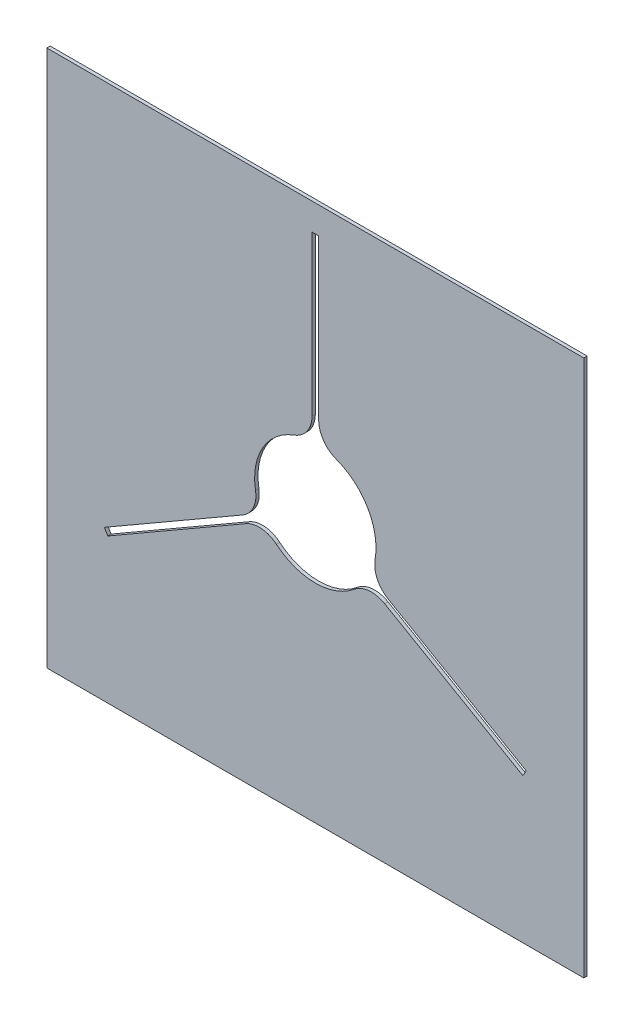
ISO-10303-21;
HEADER;
FILE_DESCRIPTION(('STEP AP214'),'2;1');
FILE_NAME('part.step','',(''),(''),'','','');
FILE_SCHEMA(('AUTOMOTIVE_DESIGN { 1 0 10303 214 1 1 1 1 }'));
ENDSEC;
DATA;
#1=APPLICATION_CONTEXT('core data for automotive mechanical design processes');
#2=APPLICATION_PROTOCOL_DEFINITION('international standard','automotive_design',2000,#1);
#3=PRODUCT_CONTEXT('',#1,'mechanical');
#4=PRODUCT('Part','Part','',(#3));
#5=PRODUCT_RELATED_PRODUCT_CATEGORY('part','',(#4));
#6=PRODUCT_DEFINITION_FORMATION('','',#4);
#7=PRODUCT_DEFINITION_CONTEXT('part definition',#1,'design');
#8=PRODUCT_DEFINITION('design','',#6,#7);
#9=PRODUCT_DEFINITION_SHAPE('','',#8);
#10=(LENGTH_UNIT() NAMED_UNIT(*) SI_UNIT(.MILLI.,.METRE.));
#11=(NAMED_UNIT(*) PLANE_ANGLE_UNIT() SI_UNIT($,.RADIAN.));
#12=(NAMED_UNIT(*) SI_UNIT($,.STERADIAN.) SOLID_ANGLE_UNIT());
#13=UNCERTAINTY_MEASURE_WITH_UNIT(LENGTH_MEASURE(1.E-05),#10,'distance_accuracy_value','');
#14=(GEOMETRIC_REPRESENTATION_CONTEXT(3) GLOBAL_UNCERTAINTY_ASSIGNED_CONTEXT((#13)) GLOBAL_UNIT_ASSIGNED_CONTEXT((#10,
#11,#12)) REPRESENTATION_CONTEXT('',''));
#15=CARTESIAN_POINT('',(0.,0.,0.));
#16=DIRECTION('',(0.,0.,1.));
#17=DIRECTION('',(1.,0.,0.));
#18=AXIS2_PLACEMENT_3D('',#15,#16,#17);
#19=CARTESIAN_POINT('',(0.,0.,0.));
#20=DIRECTION('',(0.,0.,1.));
#21=DIRECTION('',(1.,0.,0.));
#22=AXIS2_PLACEMENT_3D('',#19,#20,#21);
#23=CYLINDRICAL_SURFACE('',#22,28.702);
#24=CARTESIAN_POINT('',(0.,0.,1.5875));
#25=DIRECTION('',(0.,0.,1.));
#26=DIRECTION('',(1.,0.,0.));
#27=AXIS2_PLACEMENT_3D('',#24,#25,#26);
#28=CIRCLE('',#27,28.702);
#29=CARTESIAN_POINT('',(-9.90483128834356,26.9388032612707,1.5875));
#30=VERTEX_POINT('',#29);
#31=CARTESIAN_POINT('',(-28.2821036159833,-4.89156611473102,1.5875));
#32=VERTEX_POINT('',#31);
#33=EDGE_CURVE('E271',#30,#32,#28,.T.);
#34=ORIENTED_EDGE('',*,*,#33,.T.);
#35=DIRECTION('',(0.,0.,1.));
#36=VECTOR('',#35,1.);
#37=CARTESIAN_POINT('',(-28.2821036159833,-4.89156611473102,0.));
#38=LINE('',#37,#36);
#39=CARTESIAN_POINT('',(-28.2821036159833,-4.89156611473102,0.));
#40=VERTEX_POINT('',#39);
#41=EDGE_CURVE('E323',#32,#40,#38,.F.);
#42=ORIENTED_EDGE('',*,*,#41,.T.);
#43=CARTESIAN_POINT('',(0.,0.,0.));
#44=DIRECTION('',(0.,0.,1.));
#45=DIRECTION('',(1.,0.,0.));
#46=AXIS2_PLACEMENT_3D('',#43,#44,#45);
#47=CIRCLE('',#46,28.702);
#48=CARTESIAN_POINT('',(-9.90483128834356,26.9388032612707,0.));
#49=VERTEX_POINT('',#48);
#50=EDGE_CURVE('E265',#49,#40,#47,.T.);
#51=ORIENTED_EDGE('',*,*,#50,.F.);
#52=DIRECTION('',(0.,0.,1.));
#53=VECTOR('',#52,1.);
#54=CARTESIAN_POINT('',(-9.90483128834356,26.9388032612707,0.));
#55=LINE('',#54,#53);
#56=EDGE_CURVE('E304',#49,#30,#55,.T.);
#57=ORIENTED_EDGE('',*,*,#56,.T.);
#58=EDGE_LOOP('',(#34,#42,#51,#57));
#59=FACE_BOUND('',#58,.T.);
#60=ADVANCED_FACE('F39',(#59),#23,.F.);
#61=CARTESIAN_POINT('',(-18.3772723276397,-22.0472371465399,1.5875));
#62=VERTEX_POINT('',#61);
#63=CARTESIAN_POINT('',(18.37727232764,-22.0472371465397,1.5875));
#64=VERTEX_POINT('',#63);
#65=EDGE_CURVE('E274',#62,#64,#28,.T.);
#66=ORIENTED_EDGE('',*,*,#65,.T.);
#67=DIRECTION('',(0.,0.,1.));
#68=VECTOR('',#67,1.);
#69=CARTESIAN_POINT('',(18.37727232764,-22.0472371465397,0.));
#70=LINE('',#69,#68);
#71=CARTESIAN_POINT('',(18.37727232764,-22.0472371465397,0.));
#72=VERTEX_POINT('',#71);
#73=EDGE_CURVE('E341',#64,#72,#70,.F.);
#74=ORIENTED_EDGE('',*,*,#73,.T.);
#75=CARTESIAN_POINT('',(-18.3772723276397,-22.0472371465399,0.));
#76=VERTEX_POINT('',#75);
#77=EDGE_CURVE('E269',#76,#72,#47,.T.);
#78=ORIENTED_EDGE('',*,*,#77,.F.);
#79=DIRECTION('',(0.,0.,1.));
#80=VECTOR('',#79,1.);
#81=CARTESIAN_POINT('',(-18.3772723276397,-22.0472371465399,0.));
#82=LINE('',#81,#80);
#83=EDGE_CURVE('E336',#76,#62,#82,.T.);
#84=ORIENTED_EDGE('',*,*,#83,.T.);
#85=EDGE_LOOP('',(#66,#74,#78,#84));
#86=FACE_BOUND('',#85,.T.);
#87=ADVANCED_FACE('F364',(#86),#23,.F.);
#88=CARTESIAN_POINT('',(127.,127.,1.5875));
#89=DIRECTION('',(-1.,0.,0.));
#90=DIRECTION('',(0.,-1.,0.));
#91=AXIS2_PLACEMENT_3D('',#88,#89,#90);
#92=PLANE('',#91);
#93=DIRECTION('',(0.,1.,0.));
#94=VECTOR('',#93,1.);
#95=CARTESIAN_POINT('',(127.,127.,0.));
#96=LINE('',#95,#94);
#97=CARTESIAN_POINT('',(127.,-127.,0.));
#98=VERTEX_POINT('',#97);
#99=CARTESIAN_POINT('',(127.,127.,0.));
#100=VERTEX_POINT('',#99);
#101=EDGE_CURVE('E268',#98,#100,#96,.T.);
#102=ORIENTED_EDGE('',*,*,#101,.T.);
#103=DIRECTION('',(0.,0.,-1.));
#104=VECTOR('',#103,1.);
#105=CARTESIAN_POINT('',(127.,127.,1.5875));
#106=LINE('',#105,#104);
#107=CARTESIAN_POINT('',(127.,127.,1.5875));
#108=VERTEX_POINT('',#107);
#109=EDGE_CURVE('E301',#108,#100,#106,.T.);
#110=ORIENTED_EDGE('',*,*,#109,.F.);
#111=DIRECTION('',(0.,1.,0.));
#112=VECTOR('',#111,1.);
#113=CARTESIAN_POINT('',(127.,127.,1.5875));
#114=LINE('',#113,#112);
#115=CARTESIAN_POINT('',(127.,-127.,1.5875));
#116=VERTEX_POINT('',#115);
#117=EDGE_CURVE('E275',#116,#108,#114,.T.);
#118=ORIENTED_EDGE('',*,*,#117,.F.);
#119=DIRECTION('',(0.,0.,-1.));
#120=VECTOR('',#119,1.);
#121=CARTESIAN_POINT('',(127.,-127.,1.5875));
#122=LINE('',#121,#120);
#123=EDGE_CURVE('E285',#116,#98,#122,.T.);
#124=ORIENTED_EDGE('',*,*,#123,.T.);
#125=EDGE_LOOP('',(#102,#110,#118,#124));
#126=FACE_BOUND('',#125,.T.);
#127=ADVANCED_FACE('F431',(#126),#92,.F.);
#128=CARTESIAN_POINT('',(-127.,127.,1.5875));
#129=DIRECTION('',(0.,-1.,0.));
#130=DIRECTION('',(0.,0.,-1.));
#131=AXIS2_PLACEMENT_3D('',#128,#129,#130);
#132=PLANE('',#131);
#133=DIRECTION('',(-1.,0.,0.));
#134=VECTOR('',#133,1.);
#135=CARTESIAN_POINT('',(-127.,127.,0.));
#136=LINE('',#135,#134);
#137=CARTESIAN_POINT('',(-127.,127.,0.));
#138=VERTEX_POINT('',#137);
#139=EDGE_CURVE('E288',#100,#138,#136,.T.);
#140=ORIENTED_EDGE('',*,*,#139,.T.);
#141=DIRECTION('',(0.,0.,-1.));
#142=VECTOR('',#141,1.);
#143=CARTESIAN_POINT('',(-127.,127.,1.5875));
#144=LINE('',#143,#142);
#145=CARTESIAN_POINT('',(-127.,127.,1.5875));
#146=VERTEX_POINT('',#145);
#147=EDGE_CURVE('E298',#146,#138,#144,.T.);
#148=ORIENTED_EDGE('',*,*,#147,.F.);
#149=DIRECTION('',(-1.,0.,0.));
#150=VECTOR('',#149,1.);
#151=CARTESIAN_POINT('',(-127.,127.,1.5875));
#152=LINE('',#151,#150);
#153=EDGE_CURVE('E278',#108,#146,#152,.T.);
#154=ORIENTED_EDGE('',*,*,#153,.F.);
#155=ORIENTED_EDGE('',*,*,#109,.T.);
#156=EDGE_LOOP('',(#140,#148,#154,#155));
#157=FACE_BOUND('',#156,.T.);
#158=ADVANCED_FACE('F452',(#157),#132,.F.);
#159=CARTESIAN_POINT('',(-127.,127.,1.5875));
#160=DIRECTION('',(1.,0.,0.));
#161=DIRECTION('',(0.,1.,0.));
#162=AXIS2_PLACEMENT_3D('',#159,#160,#161);
#163=PLANE('',#162);
#164=DIRECTION('',(0.,-1.,0.));
#165=VECTOR('',#164,1.);
#166=CARTESIAN_POINT('',(-127.,127.,0.));
#167=LINE('',#166,#165);
#168=CARTESIAN_POINT('',(-127.,-127.,0.));
#169=VERTEX_POINT('',#168);
#170=EDGE_CURVE('E290',#138,#169,#167,.T.);
#171=ORIENTED_EDGE('',*,*,#170,.T.);
#172=DIRECTION('',(0.,0.,-1.));
#173=VECTOR('',#172,1.);
#174=CARTESIAN_POINT('',(-127.,-127.,1.5875));
#175=LINE('',#174,#173);
#176=CARTESIAN_POINT('',(-127.,-127.,1.5875));
#177=VERTEX_POINT('',#176);
#178=EDGE_CURVE('E295',#177,#169,#175,.T.);
#179=ORIENTED_EDGE('',*,*,#178,.F.);
#180=DIRECTION('',(0.,-1.,0.));
#181=VECTOR('',#180,1.);
#182=CARTESIAN_POINT('',(-127.,127.,1.5875));
#183=LINE('',#182,#181);
#184=EDGE_CURVE('E281',#146,#177,#183,.T.);
#185=ORIENTED_EDGE('',*,*,#184,.F.);
#186=ORIENTED_EDGE('',*,*,#147,.T.);
#187=EDGE_LOOP('',(#171,#179,#185,#186));
#188=FACE_BOUND('',#187,.T.);
#189=ADVANCED_FACE('F448',(#188),#163,.F.);
#190=CARTESIAN_POINT('',(-127.,-127.,1.5875));
#191=DIRECTION('',(0.,1.,0.));
#192=DIRECTION('',(0.,0.,1.));
#193=AXIS2_PLACEMENT_3D('',#190,#191,#192);
#194=PLANE('',#193);
#195=DIRECTION('',(1.,0.,0.));
#196=VECTOR('',#195,1.);
#197=CARTESIAN_POINT('',(-127.,-127.,0.));
#198=LINE('',#197,#196);
#199=EDGE_CURVE('E279',#169,#98,#198,.T.);
#200=ORIENTED_EDGE('',*,*,#199,.T.);
#201=ORIENTED_EDGE('',*,*,#123,.F.);
#202=DIRECTION('',(1.,0.,0.));
#203=VECTOR('',#202,1.);
#204=CARTESIAN_POINT('',(-127.,-127.,1.5875));
#205=LINE('',#204,#203);
#206=EDGE_CURVE('E283',#177,#116,#205,.T.);
#207=ORIENTED_EDGE('',*,*,#206,.F.);
#208=ORIENTED_EDGE('',*,*,#178,.T.);
#209=EDGE_LOOP('',(#200,#201,#207,#208));
#210=FACE_BOUND('',#209,.T.);
#211=ADVANCED_FACE('F444',(#210),#194,.F.);
#212=CARTESIAN_POINT('',(0.,0.,1.5875));
#213=DIRECTION('',(0.,0.,1.));
#214=DIRECTION('',(1.,0.,0.));
#215=AXIS2_PLACEMENT_3D('',#212,#213,#214);
#216=PLANE('',#215);
#217=DIRECTION('',(0.866025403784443,-0.499999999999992,0.));
#218=VECTOR('',#217,1.);
#219=CARTESIAN_POINT('',(98.1929536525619,-58.5248153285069,1.5875));
#220=LINE('',#219,#218);
#221=CARTESIAN_POINT('',(32.8588087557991,-20.8041291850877,1.5875));
#222=VERTEX_POINT('',#221);
#223=CARTESIAN_POINT('',(98.1929536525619,-58.5248153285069,1.5875));
#224=VERTEX_POINT('',#223);
#225=EDGE_CURVE('E205',#222,#224,#220,.T.);
#226=ORIENTED_EDGE('',*,*,#225,.F.);
#227=CARTESIAN_POINT('',(26.5088087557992,-31.8026518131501,1.5875));
#228=DIRECTION('',(0.,0.,1.));
#229=DIRECTION('',(1.,0.,0.));
#230=AXIS2_PLACEMENT_3D('',#227,#228,#229);
#231=CIRCLE('',#230,12.7);
#232=EDGE_CURVE('E350',#222,#64,#231,.T.);
#233=ORIENTED_EDGE('',*,*,#232,.T.);
#234=ORIENTED_EDGE('',*,*,#65,.F.);
#235=CARTESIAN_POINT('',(-26.5088087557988,-31.8026518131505,1.5875));
#236=DIRECTION('',(0.,0.,1.));
#237=DIRECTION('',(1.,0.,0.));
#238=AXIS2_PLACEMENT_3D('',#235,#236,#237);
#239=CIRCLE('',#238,12.7);
#240=CARTESIAN_POINT('',(-32.8588087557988,-20.8041291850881,1.5875));
#241=VERTEX_POINT('',#240);
#242=EDGE_CURVE('E332',#62,#241,#239,.T.);
#243=ORIENTED_EDGE('',*,*,#242,.T.);
#244=DIRECTION('',(0.866025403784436,0.500000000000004,0.));
#245=VECTOR('',#244,1.);
#246=CARTESIAN_POINT('',(-98.1929536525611,-58.5248153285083,1.5875));
#247=LINE('',#246,#245);
#248=CARTESIAN_POINT('',(-98.1929536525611,-58.5248153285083,1.5875));
#249=VERTEX_POINT('',#248);
#250=EDGE_CURVE('E226',#249,#241,#247,.T.);
#251=ORIENTED_EDGE('',*,*,#250,.F.);
#252=DIRECTION('',(0.500000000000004,-0.866025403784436,0.));
#253=VECTOR('',#252,1.);
#254=CARTESIAN_POINT('',(-98.1929536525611,-58.5248153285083,1.5875));
#255=LINE('',#254,#253);
#256=CARTESIAN_POINT('',(-99.7804536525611,-55.7751846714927,1.5875));
#257=VERTEX_POINT('',#256);
#258=EDGE_CURVE('E234',#257,#249,#255,.T.);
#259=ORIENTED_EDGE('',*,*,#258,.F.);
#260=DIRECTION('',(-0.866025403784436,-0.500000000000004,0.));
#261=VECTOR('',#260,1.);
#262=CARTESIAN_POINT('',(-99.7804536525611,-55.7751846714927,1.5875));
#263=LINE('',#262,#261);
#264=CARTESIAN_POINT('',(-34.4463087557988,-18.0544985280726,1.5875));
#265=VERTEX_POINT('',#264);
#266=EDGE_CURVE('E221',#265,#257,#263,.T.);
#267=ORIENTED_EDGE('',*,*,#266,.F.);
#268=CARTESIAN_POINT('',(-40.7963087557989,-7.05597590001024,1.5875));
#269=DIRECTION('',(0.,0.,1.));
#270=DIRECTION('',(1.,0.,0.));
#271=AXIS2_PLACEMENT_3D('',#268,#269,#270);
#272=CIRCLE('',#271,12.7);
#273=EDGE_CURVE('E334',#265,#32,#272,.T.);
#274=ORIENTED_EDGE('',*,*,#273,.T.);
#275=ORIENTED_EDGE('',*,*,#33,.F.);
#276=CARTESIAN_POINT('',(-14.2875,38.8586277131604,1.5875));
#277=DIRECTION('',(0.,0.,1.));
#278=DIRECTION('',(1.,0.,0.));
#279=AXIS2_PLACEMENT_3D('',#276,#277,#278);
#280=CIRCLE('',#279,12.7);
#281=CARTESIAN_POINT('',(-1.5875,38.8586277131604,1.5875));
#282=VERTEX_POINT('',#281);
#283=EDGE_CURVE('E316',#30,#282,#280,.T.);
#284=ORIENTED_EDGE('',*,*,#283,.T.);
#285=DIRECTION('',(0.,-1.,0.));
#286=VECTOR('',#285,1.);
#287=CARTESIAN_POINT('',(-1.58750000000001,114.3,1.5875));
#288=LINE('',#287,#286);
#289=CARTESIAN_POINT('',(-1.58750000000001,114.3,1.5875));
#290=VERTEX_POINT('',#289);
#291=EDGE_CURVE('E247',#290,#282,#288,.T.);
#292=ORIENTED_EDGE('',*,*,#291,.F.);
#293=DIRECTION('',(-1.,0.,0.));
#294=VECTOR('',#293,1.);
#295=CARTESIAN_POINT('',(-1.58750000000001,114.3,1.5875));
#296=LINE('',#295,#294);
#297=CARTESIAN_POINT('',(1.58749999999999,114.3,1.5875));
#298=VERTEX_POINT('',#297);
#299=EDGE_CURVE('E255',#298,#290,#296,.T.);
#300=ORIENTED_EDGE('',*,*,#299,.F.);
#301=DIRECTION('',(0.,1.,0.));
#302=VECTOR('',#301,1.);
#303=CARTESIAN_POINT('',(1.58749999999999,114.3,1.5875));
#304=LINE('',#303,#302);
#305=CARTESIAN_POINT('',(1.5875,38.8586277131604,1.5875));
#306=VERTEX_POINT('',#305);
#307=EDGE_CURVE('E241',#306,#298,#304,.T.);
#308=ORIENTED_EDGE('',*,*,#307,.F.);
#309=CARTESIAN_POINT('',(14.2875,38.8586277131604,1.5875));
#310=DIRECTION('',(0.,0.,1.));
#311=DIRECTION('',(1.,0.,0.));
#312=AXIS2_PLACEMENT_3D('',#309,#310,#311);
#313=CIRCLE('',#312,12.7);
#314=CARTESIAN_POINT('',(9.90483128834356,26.9388032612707,1.5875));
#315=VERTEX_POINT('',#314);
#316=EDGE_CURVE('E318',#306,#315,#313,.T.);
#317=ORIENTED_EDGE('',*,*,#316,.T.);
#318=CARTESIAN_POINT('',(28.2821036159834,-4.89156611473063,1.5875));
#319=VERTEX_POINT('',#318);
#320=EDGE_CURVE('E262',#319,#315,#28,.T.);
#321=ORIENTED_EDGE('',*,*,#320,.F.);
#322=CARTESIAN_POINT('',(40.796308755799,-7.05597590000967,1.5875));
#323=DIRECTION('',(0.,0.,1.));
#324=DIRECTION('',(1.,0.,0.));
#325=AXIS2_PLACEMENT_3D('',#322,#323,#324);
#326=CIRCLE('',#325,12.7);
#327=CARTESIAN_POINT('',(34.4463087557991,-18.0544985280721,1.5875));
#328=VERTEX_POINT('',#327);
#329=EDGE_CURVE('E54',#319,#328,#326,.T.);
#330=ORIENTED_EDGE('',*,*,#329,.T.);
#331=DIRECTION('',(-0.866025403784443,0.499999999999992,0.));
#332=VECTOR('',#331,1.);
#333=CARTESIAN_POINT('',(99.7804536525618,-55.7751846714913,1.5875));
#334=LINE('',#333,#332);
#335=CARTESIAN_POINT('',(99.7804536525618,-55.7751846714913,1.5875));
#336=VERTEX_POINT('',#335);
#337=EDGE_CURVE('E199',#336,#328,#334,.T.);
#338=ORIENTED_EDGE('',*,*,#337,.F.);
#339=DIRECTION('',(0.499999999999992,0.866025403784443,0.));
#340=VECTOR('',#339,1.);
#341=CARTESIAN_POINT('',(99.7804536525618,-55.7751846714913,1.5875));
#342=LINE('',#341,#340);
#343=EDGE_CURVE('E218',#224,#336,#342,.T.);
#344=ORIENTED_EDGE('',*,*,#343,.F.);
#345=EDGE_LOOP('',(#226,#233,#234,#243,#251,#259,#267,#274,#275,#284,#292,#300,#308,#317,#321,
#330,#338,#344));
#346=FACE_BOUND('',#345,.T.);
#347=ORIENTED_EDGE('',*,*,#117,.T.);
#348=ORIENTED_EDGE('',*,*,#153,.T.);
#349=ORIENTED_EDGE('',*,*,#184,.T.);
#350=ORIENTED_EDGE('',*,*,#206,.T.);
#351=EDGE_LOOP('',(#347,#348,#349,#350));
#352=FACE_BOUND('',#351,.T.);
#353=ADVANCED_FACE('F355',(#346,#352),#216,.T.);
#354=CARTESIAN_POINT('',(0.,0.,0.));
#355=DIRECTION('',(0.,0.,1.));
#356=DIRECTION('',(1.,0.,0.));
#357=AXIS2_PLACEMENT_3D('',#354,#355,#356);
#358=PLANE('',#357);
#359=ORIENTED_EDGE('',*,*,#77,.T.);
#360=CARTESIAN_POINT('',(26.5088087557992,-31.8026518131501,0.));
#361=DIRECTION('',(0.,0.,1.));
#362=DIRECTION('',(1.,0.,0.));
#363=AXIS2_PLACEMENT_3D('',#360,#361,#362);
#364=CIRCLE('',#363,12.7);
#365=CARTESIAN_POINT('',(32.8588087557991,-20.8041291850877,0.));
#366=VERTEX_POINT('',#365);
#367=EDGE_CURVE('E196',#72,#366,#364,.F.);
#368=ORIENTED_EDGE('',*,*,#367,.T.);
#369=DIRECTION('',(0.866025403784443,-0.499999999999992,0.));
#370=VECTOR('',#369,1.);
#371=CARTESIAN_POINT('',(98.1929536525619,-58.5248153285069,0.));
#372=LINE('',#371,#370);
#373=CARTESIAN_POINT('',(98.1929536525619,-58.5248153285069,0.));
#374=VERTEX_POINT('',#373);
#375=EDGE_CURVE('E188',#366,#374,#372,.T.);
#376=ORIENTED_EDGE('',*,*,#375,.T.);
#377=DIRECTION('',(0.499999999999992,0.866025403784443,0.));
#378=VECTOR('',#377,1.);
#379=CARTESIAN_POINT('',(99.7804536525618,-55.7751846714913,0.));
#380=LINE('',#379,#378);
#381=CARTESIAN_POINT('',(99.7804536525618,-55.7751846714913,0.));
#382=VERTEX_POINT('',#381);
#383=EDGE_CURVE('E195',#374,#382,#380,.T.);
#384=ORIENTED_EDGE('',*,*,#383,.T.);
#385=DIRECTION('',(-0.866025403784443,0.499999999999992,0.));
#386=VECTOR('',#385,1.);
#387=CARTESIAN_POINT('',(99.7804536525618,-55.7751846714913,0.));
#388=LINE('',#387,#386);
#389=CARTESIAN_POINT('',(34.4463087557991,-18.0544985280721,0.));
#390=VERTEX_POINT('',#389);
#391=EDGE_CURVE('E210',#382,#390,#388,.T.);
#392=ORIENTED_EDGE('',*,*,#391,.T.);
#393=CARTESIAN_POINT('',(40.796308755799,-7.05597590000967,0.));
#394=DIRECTION('',(0.,0.,1.));
#395=DIRECTION('',(1.,0.,0.));
#396=AXIS2_PLACEMENT_3D('',#393,#394,#395);
#397=CIRCLE('',#396,12.7);
#398=CARTESIAN_POINT('',(28.2821036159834,-4.89156611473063,0.));
#399=VERTEX_POINT('',#398);
#400=EDGE_CURVE('E344',#390,#399,#397,.F.);
#401=ORIENTED_EDGE('',*,*,#400,.T.);
#402=CARTESIAN_POINT('',(9.90483128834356,26.9388032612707,0.));
#403=VERTEX_POINT('',#402);
#404=EDGE_CURVE('E270',#399,#403,#47,.T.);
#405=ORIENTED_EDGE('',*,*,#404,.T.);
#406=CARTESIAN_POINT('',(14.2875,38.8586277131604,0.));
#407=DIRECTION('',(0.,0.,1.));
#408=DIRECTION('',(1.,0.,0.));
#409=AXIS2_PLACEMENT_3D('',#406,#407,#408);
#410=CIRCLE('',#409,12.7);
#411=CARTESIAN_POINT('',(1.5875,38.8586277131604,0.));
#412=VERTEX_POINT('',#411);
#413=EDGE_CURVE('E312',#403,#412,#410,.F.);
#414=ORIENTED_EDGE('',*,*,#413,.T.);
#415=DIRECTION('',(0.,1.,0.));
#416=VECTOR('',#415,1.);
#417=CARTESIAN_POINT('',(1.58749999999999,114.3,0.));
#418=LINE('',#417,#416);
#419=CARTESIAN_POINT('',(1.58749999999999,114.3,0.));
#420=VERTEX_POINT('',#419);
#421=EDGE_CURVE('E244',#412,#420,#418,.T.);
#422=ORIENTED_EDGE('',*,*,#421,.T.);
#423=DIRECTION('',(-1.,0.,0.));
#424=VECTOR('',#423,1.);
#425=CARTESIAN_POINT('',(-1.58750000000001,114.3,0.));
#426=LINE('',#425,#424);
#427=CARTESIAN_POINT('',(-1.58750000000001,114.3,0.));
#428=VERTEX_POINT('',#427);
#429=EDGE_CURVE('E246',#420,#428,#426,.T.);
#430=ORIENTED_EDGE('',*,*,#429,.T.);
#431=DIRECTION('',(0.,-1.,0.));
#432=VECTOR('',#431,1.);
#433=CARTESIAN_POINT('',(-1.58750000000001,114.3,0.));
#434=LINE('',#433,#432);
#435=CARTESIAN_POINT('',(-1.5875,38.8586277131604,0.));
#436=VERTEX_POINT('',#435);
#437=EDGE_CURVE('E250',#428,#436,#434,.T.);
#438=ORIENTED_EDGE('',*,*,#437,.T.);
#439=CARTESIAN_POINT('',(-14.2875,38.8586277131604,0.));
#440=DIRECTION('',(0.,0.,1.));
#441=DIRECTION('',(1.,0.,0.));
#442=AXIS2_PLACEMENT_3D('',#439,#440,#441);
#443=CIRCLE('',#442,12.7);
#444=EDGE_CURVE('E310',#436,#49,#443,.F.);
#445=ORIENTED_EDGE('',*,*,#444,.T.);
#446=ORIENTED_EDGE('',*,*,#50,.T.);
#447=CARTESIAN_POINT('',(-40.7963087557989,-7.05597590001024,0.));
#448=DIRECTION('',(0.,0.,1.));
#449=DIRECTION('',(1.,0.,0.));
#450=AXIS2_PLACEMENT_3D('',#447,#448,#449);
#451=CIRCLE('',#450,12.7);
#452=CARTESIAN_POINT('',(-34.4463087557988,-18.0544985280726,0.));
#453=VERTEX_POINT('',#452);
#454=EDGE_CURVE('E328',#40,#453,#451,.F.);
#455=ORIENTED_EDGE('',*,*,#454,.T.);
#456=DIRECTION('',(-0.866025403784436,-0.500000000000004,0.));
#457=VECTOR('',#456,1.);
#458=CARTESIAN_POINT('',(-99.7804536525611,-55.7751846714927,0.));
#459=LINE('',#458,#457);
#460=CARTESIAN_POINT('',(-99.7804536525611,-55.7751846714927,0.));
#461=VERTEX_POINT('',#460);
#462=EDGE_CURVE('E223',#453,#461,#459,.T.);
#463=ORIENTED_EDGE('',*,*,#462,.T.);
#464=DIRECTION('',(0.500000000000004,-0.866025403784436,0.));
#465=VECTOR('',#464,1.);
#466=CARTESIAN_POINT('',(-98.1929536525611,-58.5248153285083,0.));
#467=LINE('',#466,#465);
#468=CARTESIAN_POINT('',(-98.1929536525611,-58.5248153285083,0.));
#469=VERTEX_POINT('',#468);
#470=EDGE_CURVE('E225',#461,#469,#467,.T.);
#471=ORIENTED_EDGE('',*,*,#470,.T.);
#472=DIRECTION('',(0.866025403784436,0.500000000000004,0.));
#473=VECTOR('',#472,1.);
#474=CARTESIAN_POINT('',(-98.1929536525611,-58.5248153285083,0.));
#475=LINE('',#474,#473);
#476=CARTESIAN_POINT('',(-32.8588087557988,-20.8041291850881,0.));
#477=VERTEX_POINT('',#476);
#478=EDGE_CURVE('E229',#469,#477,#475,.T.);
#479=ORIENTED_EDGE('',*,*,#478,.T.);
#480=CARTESIAN_POINT('',(-26.5088087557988,-31.8026518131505,0.));
#481=DIRECTION('',(0.,0.,1.));
#482=DIRECTION('',(1.,0.,0.));
#483=AXIS2_PLACEMENT_3D('',#480,#481,#482);
#484=CIRCLE('',#483,12.7);
#485=EDGE_CURVE('E326',#477,#76,#484,.F.);
#486=ORIENTED_EDGE('',*,*,#485,.T.);
#487=EDGE_LOOP('',(#359,#368,#376,#384,#392,#401,#405,#414,#422,#430,#438,#445,#446,#455,#463,
#471,#479,#486));
#488=FACE_BOUND('',#487,.T.);
#489=ORIENTED_EDGE('',*,*,#101,.F.);
#490=ORIENTED_EDGE('',*,*,#199,.F.);
#491=ORIENTED_EDGE('',*,*,#170,.F.);
#492=ORIENTED_EDGE('',*,*,#139,.F.);
#493=EDGE_LOOP('',(#489,#490,#491,#492));
#494=FACE_BOUND('',#493,.T.);
#495=ADVANCED_FACE('F191',(#488,#494),#358,.F.);
#496=ORIENTED_EDGE('',*,*,#404,.F.);
#497=DIRECTION('',(0.,0.,1.));
#498=VECTOR('',#497,1.);
#499=CARTESIAN_POINT('',(28.2821036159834,-4.89156611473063,0.));
#500=LINE('',#499,#498);
#501=EDGE_CURVE('E47',#399,#319,#500,.T.);
#502=ORIENTED_EDGE('',*,*,#501,.T.);
#503=ORIENTED_EDGE('',*,*,#320,.T.);
#504=DIRECTION('',(0.,0.,1.));
#505=VECTOR('',#504,1.);
#506=CARTESIAN_POINT('',(9.90483128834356,26.9388032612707,0.));
#507=LINE('',#506,#505);
#508=EDGE_CURVE('E307',#315,#403,#507,.F.);
#509=ORIENTED_EDGE('',*,*,#508,.T.);
#510=EDGE_LOOP('',(#496,#502,#503,#509));
#511=FACE_BOUND('',#510,.T.);
#512=ADVANCED_FACE('F353',(#511),#23,.F.);
#513=CARTESIAN_POINT('',(1.58749999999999,114.3,0.));
#514=DIRECTION('',(1.,0.,0.));
#515=DIRECTION('',(0.,1.,0.));
#516=AXIS2_PLACEMENT_3D('',#513,#514,#515);
#517=PLANE('',#516);
#518=ORIENTED_EDGE('',*,*,#421,.F.);
#519=DIRECTION('',(0.,0.,1.));
#520=VECTOR('',#519,1.);
#521=CARTESIAN_POINT('',(1.5875,38.8586277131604,0.));
#522=LINE('',#521,#520);
#523=EDGE_CURVE('E314',#412,#306,#522,.T.);
#524=ORIENTED_EDGE('',*,*,#523,.T.);
#525=ORIENTED_EDGE('',*,*,#307,.T.);
#526=DIRECTION('',(0.,0.,1.));
#527=VECTOR('',#526,1.);
#528=CARTESIAN_POINT('',(1.58749999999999,114.3,0.));
#529=LINE('',#528,#527);
#530=EDGE_CURVE('E253',#420,#298,#529,.T.);
#531=ORIENTED_EDGE('',*,*,#530,.F.);
#532=EDGE_LOOP('',(#518,#524,#525,#531));
#533=FACE_BOUND('',#532,.T.);
#534=ADVANCED_FACE('F378',(#533),#517,.F.);
#535=CARTESIAN_POINT('',(-1.58750000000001,114.3,0.));
#536=DIRECTION('',(-1.,0.,0.));
#537=DIRECTION('',(0.,-1.,0.));
#538=AXIS2_PLACEMENT_3D('',#535,#536,#537);
#539=PLANE('',#538);
#540=ORIENTED_EDGE('',*,*,#291,.T.);
#541=DIRECTION('',(0.,0.,1.));
#542=VECTOR('',#541,1.);
#543=CARTESIAN_POINT('',(-1.5875,38.8586277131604,0.));
#544=LINE('',#543,#542);
#545=EDGE_CURVE('E321',#282,#436,#544,.F.);
#546=ORIENTED_EDGE('',*,*,#545,.T.);
#547=ORIENTED_EDGE('',*,*,#437,.F.);
#548=DIRECTION('',(0.,0.,1.));
#549=VECTOR('',#548,1.);
#550=CARTESIAN_POINT('',(-1.58750000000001,114.3,0.));
#551=LINE('',#550,#549);
#552=EDGE_CURVE('E260',#428,#290,#551,.T.);
#553=ORIENTED_EDGE('',*,*,#552,.T.);
#554=EDGE_LOOP('',(#540,#546,#547,#553));
#555=FACE_BOUND('',#554,.T.);
#556=ADVANCED_FACE('F439',(#555),#539,.F.);
#557=CARTESIAN_POINT('',(-1.58750000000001,114.3,0.));
#558=DIRECTION('',(0.,1.,0.));
#559=DIRECTION('',(0.,0.,1.));
#560=AXIS2_PLACEMENT_3D('',#557,#558,#559);
#561=PLANE('',#560);
#562=ORIENTED_EDGE('',*,*,#299,.T.);
#563=ORIENTED_EDGE('',*,*,#552,.F.);
#564=ORIENTED_EDGE('',*,*,#429,.F.);
#565=ORIENTED_EDGE('',*,*,#530,.T.);
#566=EDGE_LOOP('',(#562,#563,#564,#565));
#567=FACE_BOUND('',#566,.T.);
#568=ADVANCED_FACE('F383',(#567),#561,.F.);
#569=CARTESIAN_POINT('',(14.2875,38.8586277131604,0.));
#570=DIRECTION('',(0.,0.,1.));
#571=DIRECTION('',(1.,0.,0.));
#572=AXIS2_PLACEMENT_3D('',#569,#570,#571);
#573=CYLINDRICAL_SURFACE('',#572,12.7);
#574=ORIENTED_EDGE('',*,*,#316,.F.);
#575=ORIENTED_EDGE('',*,*,#523,.F.);
#576=ORIENTED_EDGE('',*,*,#413,.F.);
#577=ORIENTED_EDGE('',*,*,#508,.F.);
#578=EDGE_LOOP('',(#574,#575,#576,#577));
#579=FACE_BOUND('',#578,.T.);
#580=ADVANCED_FACE('F376',(#579),#573,.T.);
#581=CARTESIAN_POINT('',(-14.2875,38.8586277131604,0.));
#582=DIRECTION('',(0.,0.,1.));
#583=DIRECTION('',(1.,0.,0.));
#584=AXIS2_PLACEMENT_3D('',#581,#582,#583);
#585=CYLINDRICAL_SURFACE('',#584,12.7);
#586=ORIENTED_EDGE('',*,*,#444,.F.);
#587=ORIENTED_EDGE('',*,*,#545,.F.);
#588=ORIENTED_EDGE('',*,*,#283,.F.);
#589=ORIENTED_EDGE('',*,*,#56,.F.);
#590=EDGE_LOOP('',(#586,#587,#588,#589));
#591=FACE_BOUND('',#590,.T.);
#592=ADVANCED_FACE('F392',(#591),#585,.T.);
#593=CARTESIAN_POINT('',(99.7804536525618,-55.7751846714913,0.));
#594=DIRECTION('',(0.499999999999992,0.866025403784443,0.));
#595=DIRECTION('',(-0.866025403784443,0.499999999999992,0.));
#596=AXIS2_PLACEMENT_3D('',#593,#594,#595);
#597=PLANE('',#596);
#598=ORIENTED_EDGE('',*,*,#337,.T.);
#599=DIRECTION('',(0.,0.,1.));
#600=VECTOR('',#599,1.);
#601=CARTESIAN_POINT('',(34.4463087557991,-18.0544985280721,0.));
#602=LINE('',#601,#600);
#603=EDGE_CURVE('E11',#328,#390,#602,.F.);
#604=ORIENTED_EDGE('',*,*,#603,.T.);
#605=ORIENTED_EDGE('',*,*,#391,.F.);
#606=DIRECTION('',(0.,0.,1.));
#607=VECTOR('',#606,1.);
#608=CARTESIAN_POINT('',(99.7804536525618,-55.7751846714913,0.));
#609=LINE('',#608,#607);
#610=EDGE_CURVE('E209',#382,#336,#609,.T.);
#611=ORIENTED_EDGE('',*,*,#610,.T.);
#612=EDGE_LOOP('',(#598,#604,#605,#611));
#613=FACE_BOUND('',#612,.T.);
#614=ADVANCED_FACE('F371',(#613),#597,.F.);
#615=CARTESIAN_POINT('',(98.1929536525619,-58.5248153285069,0.));
#616=DIRECTION('',(-0.499999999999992,-0.866025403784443,0.));
#617=DIRECTION('',(0.866025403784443,-0.499999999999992,0.));
#618=AXIS2_PLACEMENT_3D('',#615,#616,#617);
#619=PLANE('',#618);
#620=ORIENTED_EDGE('',*,*,#375,.F.);
#621=DIRECTION('',(0.,0.,1.));
#622=VECTOR('',#621,1.);
#623=CARTESIAN_POINT('',(32.8588087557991,-20.8041291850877,0.));
#624=LINE('',#623,#622);
#625=EDGE_CURVE('E347',#366,#222,#624,.T.);
#626=ORIENTED_EDGE('',*,*,#625,.T.);
#627=ORIENTED_EDGE('',*,*,#225,.T.);
#628=DIRECTION('',(0.,0.,1.));
#629=VECTOR('',#628,1.);
#630=CARTESIAN_POINT('',(98.1929536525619,-58.5248153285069,0.));
#631=LINE('',#630,#629);
#632=EDGE_CURVE('E202',#374,#224,#631,.T.);
#633=ORIENTED_EDGE('',*,*,#632,.F.);
#634=EDGE_LOOP('',(#620,#626,#627,#633));
#635=FACE_BOUND('',#634,.T.);
#636=ADVANCED_FACE('F203',(#635),#619,.F.);
#637=CARTESIAN_POINT('',(99.7804536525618,-55.7751846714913,0.));
#638=DIRECTION('',(0.866025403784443,-0.499999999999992,0.));
#639=DIRECTION('',(0.499999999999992,0.866025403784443,0.));
#640=AXIS2_PLACEMENT_3D('',#637,#638,#639);
#641=PLANE('',#640);
#642=ORIENTED_EDGE('',*,*,#343,.T.);
#643=ORIENTED_EDGE('',*,*,#610,.F.);
#644=ORIENTED_EDGE('',*,*,#383,.F.);
#645=ORIENTED_EDGE('',*,*,#632,.T.);
#646=EDGE_LOOP('',(#642,#643,#644,#645));
#647=FACE_BOUND('',#646,.T.);
#648=ADVANCED_FACE('F212',(#647),#641,.F.);
#649=CARTESIAN_POINT('',(-99.7804536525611,-55.7751846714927,0.));
#650=DIRECTION('',(-0.500000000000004,0.866025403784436,0.));
#651=DIRECTION('',(-0.866025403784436,-0.500000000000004,0.));
#652=AXIS2_PLACEMENT_3D('',#649,#650,#651);
#653=PLANE('',#652);
#654=ORIENTED_EDGE('',*,*,#462,.F.);
#655=DIRECTION('',(0.,0.,1.));
#656=VECTOR('',#655,1.);
#657=CARTESIAN_POINT('',(-34.4463087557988,-18.0544985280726,0.));
#658=LINE('',#657,#656);
#659=EDGE_CURVE('E330',#453,#265,#658,.T.);
#660=ORIENTED_EDGE('',*,*,#659,.T.);
#661=ORIENTED_EDGE('',*,*,#266,.T.);
#662=DIRECTION('',(0.,0.,1.));
#663=VECTOR('',#662,1.);
#664=CARTESIAN_POINT('',(-99.7804536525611,-55.7751846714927,0.));
#665=LINE('',#664,#663);
#666=EDGE_CURVE('E232',#461,#257,#665,.T.);
#667=ORIENTED_EDGE('',*,*,#666,.F.);
#668=EDGE_LOOP('',(#654,#660,#661,#667));
#669=FACE_BOUND('',#668,.T.);
#670=ADVANCED_FACE('F405',(#669),#653,.F.);
#671=CARTESIAN_POINT('',(-98.1929536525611,-58.5248153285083,0.));
#672=DIRECTION('',(0.500000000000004,-0.866025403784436,0.));
#673=DIRECTION('',(0.866025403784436,0.500000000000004,0.));
#674=AXIS2_PLACEMENT_3D('',#671,#672,#673);
#675=PLANE('',#674);
#676=ORIENTED_EDGE('',*,*,#250,.T.);
#677=DIRECTION('',(0.,0.,1.));
#678=VECTOR('',#677,1.);
#679=CARTESIAN_POINT('',(-32.8588087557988,-20.8041291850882,0.));
#680=LINE('',#679,#678);
#681=EDGE_CURVE('E339',#241,#477,#680,.F.);
#682=ORIENTED_EDGE('',*,*,#681,.T.);
#683=ORIENTED_EDGE('',*,*,#478,.F.);
#684=DIRECTION('',(0.,0.,1.));
#685=VECTOR('',#684,1.);
#686=CARTESIAN_POINT('',(-98.1929536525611,-58.5248153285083,0.));
#687=LINE('',#686,#685);
#688=EDGE_CURVE('E239',#469,#249,#687,.T.);
#689=ORIENTED_EDGE('',*,*,#688,.T.);
#690=EDGE_LOOP('',(#676,#682,#683,#689));
#691=FACE_BOUND('',#690,.T.);
#692=ADVANCED_FACE('F416',(#691),#675,.F.);
#693=CARTESIAN_POINT('',(-98.1929536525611,-58.5248153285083,0.));
#694=DIRECTION('',(-0.866025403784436,-0.500000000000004,0.));
#695=DIRECTION('',(0.500000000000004,-0.866025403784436,0.));
#696=AXIS2_PLACEMENT_3D('',#693,#694,#695);
#697=PLANE('',#696);
#698=ORIENTED_EDGE('',*,*,#258,.T.);
#699=ORIENTED_EDGE('',*,*,#688,.F.);
#700=ORIENTED_EDGE('',*,*,#470,.F.);
#701=ORIENTED_EDGE('',*,*,#666,.T.);
#702=EDGE_LOOP('',(#698,#699,#700,#701));
#703=FACE_BOUND('',#702,.T.);
#704=ADVANCED_FACE('F408',(#703),#697,.F.);
#705=CARTESIAN_POINT('',(-40.7963087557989,-7.05597590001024,0.));
#706=DIRECTION('',(0.,0.,1.));
#707=DIRECTION('',(1.,0.,0.));
#708=AXIS2_PLACEMENT_3D('',#705,#706,#707);
#709=CYLINDRICAL_SURFACE('',#708,12.7);
#710=ORIENTED_EDGE('',*,*,#273,.F.);
#711=ORIENTED_EDGE('',*,*,#659,.F.);
#712=ORIENTED_EDGE('',*,*,#454,.F.);
#713=ORIENTED_EDGE('',*,*,#41,.F.);
#714=EDGE_LOOP('',(#710,#711,#712,#713));
#715=FACE_BOUND('',#714,.T.);
#716=ADVANCED_FACE('F401',(#715),#709,.T.);
#717=CARTESIAN_POINT('',(-26.5088087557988,-31.8026518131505,0.));
#718=DIRECTION('',(0.,0.,1.));
#719=DIRECTION('',(1.,0.,0.));
#720=AXIS2_PLACEMENT_3D('',#717,#718,#719);
#721=CYLINDRICAL_SURFACE('',#720,12.7);
#722=ORIENTED_EDGE('',*,*,#485,.F.);
#723=ORIENTED_EDGE('',*,*,#681,.F.);
#724=ORIENTED_EDGE('',*,*,#242,.F.);
#725=ORIENTED_EDGE('',*,*,#83,.F.);
#726=EDGE_LOOP('',(#722,#723,#724,#725));
#727=FACE_BOUND('',#726,.T.);
#728=ADVANCED_FACE('F414',(#727),#721,.T.);
#729=CARTESIAN_POINT('',(26.5088087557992,-31.8026518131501,0.));
#730=DIRECTION('',(0.,0.,1.));
#731=DIRECTION('',(1.,0.,0.));
#732=AXIS2_PLACEMENT_3D('',#729,#730,#731);
#733=CYLINDRICAL_SURFACE('',#732,12.7);
#734=ORIENTED_EDGE('',*,*,#232,.F.);
#735=ORIENTED_EDGE('',*,*,#625,.F.);
#736=ORIENTED_EDGE('',*,*,#367,.F.);
#737=ORIENTED_EDGE('',*,*,#73,.F.);
#738=EDGE_LOOP('',(#734,#735,#736,#737));
#739=FACE_BOUND('',#738,.T.);
#740=ADVANCED_FACE('F369',(#739),#733,.T.);
#741=CARTESIAN_POINT('',(40.796308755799,-7.05597590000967,0.));
#742=DIRECTION('',(0.,0.,1.));
#743=DIRECTION('',(1.,0.,0.));
#744=AXIS2_PLACEMENT_3D('',#741,#742,#743);
#745=CYLINDRICAL_SURFACE('',#744,12.7);
#746=ORIENTED_EDGE('',*,*,#400,.F.);
#747=ORIENTED_EDGE('',*,*,#603,.F.);
#748=ORIENTED_EDGE('',*,*,#329,.F.);
#749=ORIENTED_EDGE('',*,*,#501,.F.);
#750=EDGE_LOOP('',(#746,#747,#748,#749));
#751=FACE_BOUND('',#750,.T.);
#752=ADVANCED_FACE('F41',(#751),#745,.T.);
#753=CLOSED_SHELL('',(#60,#87,#127,#158,#189,#211,#353,#495,#512,#534,#556,#568,#580,#592,#614,
#636,#648,#670,#692,#704,#716,#728,#740,#752));
#754=MANIFOLD_SOLID_BREP('B2',#753);
#755=ADVANCED_BREP_SHAPE_REPRESENTATION('',(#18,#754),#14);
#756=SHAPE_DEFINITION_REPRESENTATION(#9,#755);
ENDSEC;
END-ISO-10303-21;
